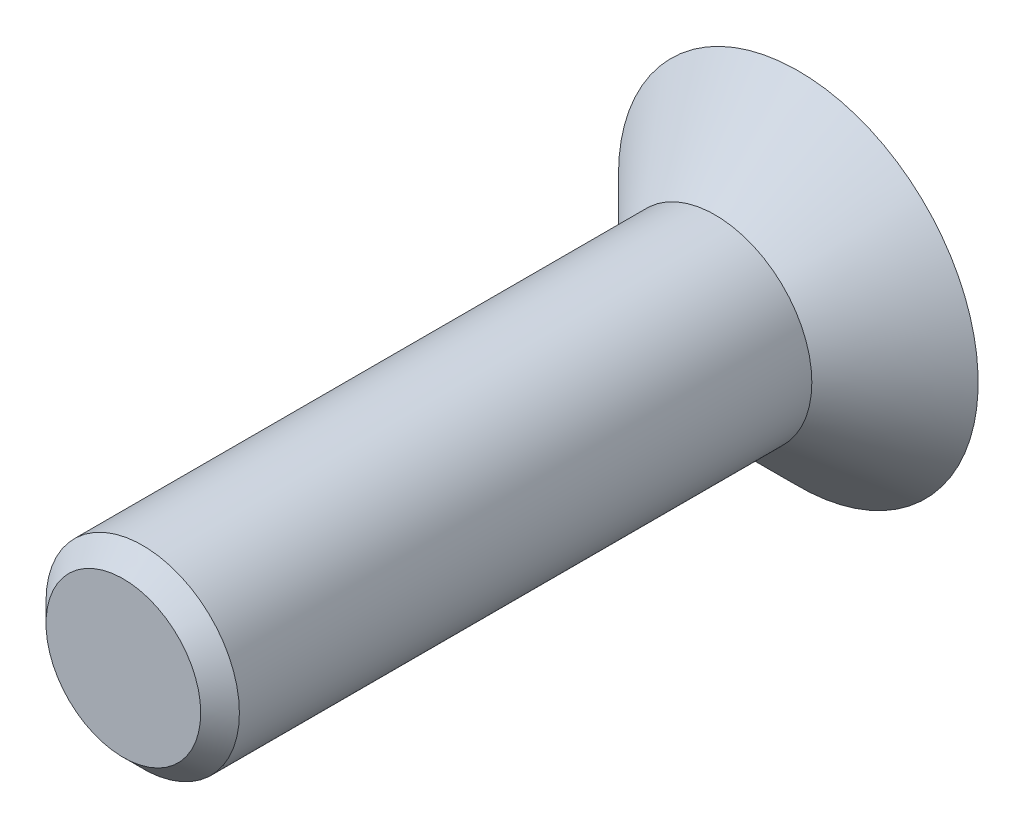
ISO-10303-21;
HEADER;
FILE_DESCRIPTION(('STEP AP214'),'2;1');
FILE_NAME('part.step','',(''),(''),'','','');
FILE_SCHEMA(('AUTOMOTIVE_DESIGN { 1 0 10303 214 1 1 1 1 }'));
ENDSEC;
DATA;
#1=APPLICATION_CONTEXT('core data for automotive mechanical design processes');
#2=APPLICATION_PROTOCOL_DEFINITION('international standard','automotive_design',2000,#1);
#3=PRODUCT_CONTEXT('',#1,'mechanical');
#4=PRODUCT('Part','Part','',(#3));
#5=PRODUCT_RELATED_PRODUCT_CATEGORY('part','',(#4));
#6=PRODUCT_DEFINITION_FORMATION('','',#4);
#7=PRODUCT_DEFINITION_CONTEXT('part definition',#1,'design');
#8=PRODUCT_DEFINITION('design','',#6,#7);
#9=PRODUCT_DEFINITION_SHAPE('','',#8);
#10=(LENGTH_UNIT() NAMED_UNIT(*) SI_UNIT(.MILLI.,.METRE.));
#11=(NAMED_UNIT(*) PLANE_ANGLE_UNIT() SI_UNIT($,.RADIAN.));
#12=(NAMED_UNIT(*) SI_UNIT($,.STERADIAN.) SOLID_ANGLE_UNIT());
#13=UNCERTAINTY_MEASURE_WITH_UNIT(LENGTH_MEASURE(1.E-05),#10,'distance_accuracy_value','');
#14=(GEOMETRIC_REPRESENTATION_CONTEXT(3) GLOBAL_UNCERTAINTY_ASSIGNED_CONTEXT((#13)) GLOBAL_UNIT_ASSIGNED_CONTEXT((#10,
#11,#12)) REPRESENTATION_CONTEXT('',''));
#15=CARTESIAN_POINT('',(0.,0.,0.));
#16=DIRECTION('',(0.,0.,1.));
#17=DIRECTION('',(1.,0.,0.));
#18=AXIS2_PLACEMENT_3D('',#15,#16,#17);
#19=CARTESIAN_POINT('',(1.31838984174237E-13,0.,-2.14999999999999));
#20=DIRECTION('',(0.,0.,1.));
#21=DIRECTION('',(1.,0.,0.));
#22=AXIS2_PLACEMENT_3D('',#19,#20,#21);
#23=PLANE('',#22);
#24=CARTESIAN_POINT('',(1.31838984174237E-13,0.,-2.14999999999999));
#25=DIRECTION('',(0.,0.,-1.));
#26=DIRECTION('',(-1.,0.,0.));
#27=AXIS2_PLACEMENT_3D('',#24,#25,#26);
#28=CIRCLE('',#27,4.65);
#29=CARTESIAN_POINT('',(-4.64999999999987,0.,-2.15));
#30=VERTEX_POINT('',#29);
#31=EDGE_CURVE('E98',#30,#30,#28,.T.);
#32=ORIENTED_EDGE('',*,*,#31,.T.);
#33=EDGE_LOOP('',(#32));
#34=FACE_BOUND('',#33,.T.);
#35=DIRECTION('',(-0.86602540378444,0.499999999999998,0.));
#36=VECTOR('',#35,1.);
#37=CARTESIAN_POINT('',(0.,1.73205080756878,-2.14999999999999));
#38=LINE('',#37,#36);
#39=CARTESIAN_POINT('',(1.50000000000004,0.866025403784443,-2.14999999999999));
#40=VERTEX_POINT('',#39);
#41=CARTESIAN_POINT('',(0.,1.73205080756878,-2.14999999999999));
#42=VERTEX_POINT('',#41);
#43=EDGE_CURVE('E45',#40,#42,#38,.T.);
#44=ORIENTED_EDGE('',*,*,#43,.T.);
#45=DIRECTION('',(-0.866025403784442,-0.500000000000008,0.));
#46=VECTOR('',#45,1.);
#47=CARTESIAN_POINT('',(-1.49999999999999,0.866025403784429,-2.14999999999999));
#48=LINE('',#47,#46);
#49=CARTESIAN_POINT('',(-1.49999999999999,0.866025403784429,-2.14999999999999));
#50=VERTEX_POINT('',#49);
#51=EDGE_CURVE('E97',#42,#50,#48,.T.);
#52=ORIENTED_EDGE('',*,*,#51,.T.);
#53=DIRECTION('',(0.,-1.00000000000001,0.));
#54=VECTOR('',#53,1.);
#55=CARTESIAN_POINT('',(-1.49999999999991,-0.866025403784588,-2.14999999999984));
#56=LINE('',#55,#54);
#57=CARTESIAN_POINT('',(-1.49999999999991,-0.866025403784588,-2.14999999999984));
#58=VERTEX_POINT('',#57);
#59=EDGE_CURVE('E148',#50,#58,#56,.T.);
#60=ORIENTED_EDGE('',*,*,#59,.T.);
#61=DIRECTION('',(0.866025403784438,-0.500000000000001,0.));
#62=VECTOR('',#61,1.);
#63=CARTESIAN_POINT('',(-1.49999999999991,-0.866025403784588,-2.14999999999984));
#64=LINE('',#63,#62);
#65=CARTESIAN_POINT('',(0.,-1.73205080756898,-2.14999999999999));
#66=VERTEX_POINT('',#65);
#67=EDGE_CURVE('E154',#58,#66,#64,.T.);
#68=ORIENTED_EDGE('',*,*,#67,.T.);
#69=DIRECTION('',(0.866025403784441,0.500000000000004,0.));
#70=VECTOR('',#69,1.);
#71=CARTESIAN_POINT('',(0.,-1.73205080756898,-2.14999999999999));
#72=LINE('',#71,#70);
#73=CARTESIAN_POINT('',(1.50000000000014,-0.866025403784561,-2.15000000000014));
#74=VERTEX_POINT('',#73);
#75=EDGE_CURVE('E157',#66,#74,#72,.T.);
#76=ORIENTED_EDGE('',*,*,#75,.T.);
#77=DIRECTION('',(0.,1.00000000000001,0.));
#78=VECTOR('',#77,1.);
#79=CARTESIAN_POINT('',(1.50000000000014,-0.866025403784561,-2.15000000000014));
#80=LINE('',#79,#78);
#81=EDGE_CURVE('E145',#74,#40,#80,.T.);
#82=ORIENTED_EDGE('',*,*,#81,.T.);
#83=EDGE_LOOP('',(#44,#52,#60,#68,#76,#82));
#84=FACE_BOUND('',#83,.T.);
#85=ADVANCED_FACE('F31',(#34,#84),#23,.F.);
#86=CARTESIAN_POINT('',(0.,0.,0.));
#87=DIRECTION('',(0.,0.,-1.));
#88=DIRECTION('',(-1.,0.,0.));
#89=AXIS2_PLACEMENT_3D('',#86,#87,#88);
#90=CONICAL_SURFACE('',#89,2.5,0.78539816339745);
#91=ORIENTED_EDGE('',*,*,#31,.F.);
#92=EDGE_LOOP('',(#91));
#93=FACE_BOUND('',#92,.T.);
#94=CARTESIAN_POINT('',(0.,0.,0.));
#95=DIRECTION('',(0.,0.,1.));
#96=DIRECTION('',(1.,0.,0.));
#97=AXIS2_PLACEMENT_3D('',#94,#95,#96);
#98=CIRCLE('',#97,2.5);
#99=CARTESIAN_POINT('',(2.5,0.,0.));
#100=VERTEX_POINT('',#99);
#101=EDGE_CURVE('E146',#100,#100,#98,.T.);
#102=ORIENTED_EDGE('',*,*,#101,.F.);
#103=EDGE_LOOP('',(#102));
#104=FACE_BOUND('',#103,.T.);
#105=ADVANCED_FACE('F133',(#93,#104),#90,.T.);
#106=CARTESIAN_POINT('',(0.,1.73205080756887,0.250000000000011));
#107=DIRECTION('',(-0.500000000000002,-0.866025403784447,0.));
#108=DIRECTION('',(0.86602540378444,-0.499999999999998,0.));
#109=AXIS2_PLACEMENT_3D('',#106,#107,#108);
#110=PLANE('',#109);
#111=DIRECTION('',(-0.86602540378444,0.499999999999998,0.));
#112=VECTOR('',#111,1.);
#113=CARTESIAN_POINT('',(0.750000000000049,1.29903810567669,0.));
#114=LINE('',#113,#112);
#115=CARTESIAN_POINT('',(1.50000000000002,0.86602540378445,0.));
#116=VERTEX_POINT('',#115);
#117=CARTESIAN_POINT('',(0.,1.73205080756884,0.));
#118=VERTEX_POINT('',#117);
#119=EDGE_CURVE('E84',#116,#118,#114,.T.);
#120=ORIENTED_EDGE('',*,*,#119,.T.);
#121=DIRECTION('',(0.,0.,-1.));
#122=VECTOR('',#121,1.);
#123=CARTESIAN_POINT('',(0.,1.73205080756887,0.250000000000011));
#124=LINE('',#123,#122);
#125=EDGE_CURVE('E91',#118,#42,#124,.T.);
#126=ORIENTED_EDGE('',*,*,#125,.T.);
#127=ORIENTED_EDGE('',*,*,#43,.F.);
#128=DIRECTION('',(0.,0.,-1.));
#129=VECTOR('',#128,1.);
#130=CARTESIAN_POINT('',(1.50000000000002,0.86602540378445,0.250000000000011));
#131=LINE('',#130,#129);
#132=EDGE_CURVE('E93',#116,#40,#131,.T.);
#133=ORIENTED_EDGE('',*,*,#132,.F.);
#134=EDGE_LOOP('',(#120,#126,#127,#133));
#135=FACE_BOUND('',#134,.T.);
#136=ADVANCED_FACE('F90',(#135),#110,.T.);
#137=CARTESIAN_POINT('',(-1.49999999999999,0.866025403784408,0.250000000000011));
#138=DIRECTION('',(0.500000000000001,-0.866025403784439,0.));
#139=DIRECTION('',(0.866025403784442,0.500000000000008,0.));
#140=AXIS2_PLACEMENT_3D('',#137,#138,#139);
#141=PLANE('',#140);
#142=DIRECTION('',(-0.866025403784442,-0.500000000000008,0.));
#143=VECTOR('',#142,1.);
#144=CARTESIAN_POINT('',(-0.749999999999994,1.29903810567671,0.));
#145=LINE('',#144,#143);
#146=CARTESIAN_POINT('',(-1.49999999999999,0.866025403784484,0.));
#147=VERTEX_POINT('',#146);
#148=EDGE_CURVE('E81',#118,#147,#145,.T.);
#149=ORIENTED_EDGE('',*,*,#148,.T.);
#150=DIRECTION('',(0.,0.,-1.));
#151=VECTOR('',#150,1.);
#152=CARTESIAN_POINT('',(-1.49999999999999,0.866025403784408,0.250000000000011));
#153=LINE('',#152,#151);
#154=EDGE_CURVE('E99',#147,#50,#153,.T.);
#155=ORIENTED_EDGE('',*,*,#154,.T.);
#156=ORIENTED_EDGE('',*,*,#51,.F.);
#157=ORIENTED_EDGE('',*,*,#125,.F.);
#158=EDGE_LOOP('',(#149,#155,#156,#157));
#159=FACE_BOUND('',#158,.T.);
#160=ADVANCED_FACE('F95',(#159),#141,.T.);
#161=CARTESIAN_POINT('',(-1.49999999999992,-0.866025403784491,0.25000000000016));
#162=DIRECTION('',(1.,0.,0.));
#163=DIRECTION('',(0.,0.,-1.));
#164=AXIS2_PLACEMENT_3D('',#161,#162,#163);
#165=PLANE('',#164);
#166=DIRECTION('',(0.,-1.00000000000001,0.));
#167=VECTOR('',#166,1.);
#168=CARTESIAN_POINT('',(-1.49999999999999,0.,0.));
#169=LINE('',#168,#167);
#170=CARTESIAN_POINT('',(-1.49999999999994,-0.866025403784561,1.52655665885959E-13));
#171=VERTEX_POINT('',#170);
#172=EDGE_CURVE('E53',#147,#171,#169,.T.);
#173=ORIENTED_EDGE('',*,*,#172,.T.);
#174=DIRECTION('',(0.,0.,-1.));
#175=VECTOR('',#174,1.);
#176=CARTESIAN_POINT('',(-1.49999999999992,-0.866025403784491,0.25000000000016));
#177=LINE('',#176,#175);
#178=EDGE_CURVE('E104',#171,#58,#177,.T.);
#179=ORIENTED_EDGE('',*,*,#178,.T.);
#180=ORIENTED_EDGE('',*,*,#59,.F.);
#181=ORIENTED_EDGE('',*,*,#154,.F.);
#182=EDGE_LOOP('',(#173,#179,#180,#181));
#183=FACE_BOUND('',#182,.T.);
#184=ADVANCED_FACE('F168',(#183),#165,.T.);
#185=CARTESIAN_POINT('',(-1.49999999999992,-0.866025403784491,0.25000000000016));
#186=DIRECTION('',(0.500000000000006,0.866025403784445,0.));
#187=DIRECTION('',(-0.866025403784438,0.500000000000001,0.));
#188=AXIS2_PLACEMENT_3D('',#185,#186,#187);
#189=PLANE('',#188);
#190=DIRECTION('',(0.866025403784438,-0.500000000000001,0.));
#191=VECTOR('',#190,1.);
#192=CARTESIAN_POINT('',(-0.749999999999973,-1.29903810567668,0.));
#193=LINE('',#192,#191);
#194=CARTESIAN_POINT('',(0.,-1.73205080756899,0.));
#195=VERTEX_POINT('',#194);
#196=EDGE_CURVE('E112',#171,#195,#193,.T.);
#197=ORIENTED_EDGE('',*,*,#196,.T.);
#198=DIRECTION('',(0.,0.,-1.));
#199=VECTOR('',#198,1.);
#200=CARTESIAN_POINT('',(0.,-1.732050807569,0.250000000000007));
#201=LINE('',#200,#199);
#202=EDGE_CURVE('E163',#195,#66,#201,.T.);
#203=ORIENTED_EDGE('',*,*,#202,.T.);
#204=ORIENTED_EDGE('',*,*,#67,.F.);
#205=ORIENTED_EDGE('',*,*,#178,.F.);
#206=EDGE_LOOP('',(#197,#203,#204,#205));
#207=FACE_BOUND('',#206,.T.);
#208=ADVANCED_FACE('F170',(#207),#189,.T.);
#209=CARTESIAN_POINT('',(0.,-1.732050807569,0.250000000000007));
#210=DIRECTION('',(-0.499999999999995,0.866025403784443,0.));
#211=DIRECTION('',(-0.866025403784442,-0.500000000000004,0.));
#212=AXIS2_PLACEMENT_3D('',#209,#210,#211);
#213=PLANE('',#212);
#214=DIRECTION('',(0.866025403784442,0.500000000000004,0.));
#215=VECTOR('',#214,1.);
#216=CARTESIAN_POINT('',(0.750000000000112,-1.29903810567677,1.56125112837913E-13));
#217=LINE('',#216,#215);
#218=CARTESIAN_POINT('',(1.50000000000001,-0.866025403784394,-1.49186218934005E-13));
#219=VERTEX_POINT('',#218);
#220=EDGE_CURVE('E109',#195,#219,#217,.T.);
#221=ORIENTED_EDGE('',*,*,#220,.T.);
#222=DIRECTION('',(0.,0.,-1.));
#223=VECTOR('',#222,1.);
#224=CARTESIAN_POINT('',(1.50000000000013,-0.866025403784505,0.249999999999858));
#225=LINE('',#224,#223);
#226=EDGE_CURVE('E161',#219,#74,#225,.T.);
#227=ORIENTED_EDGE('',*,*,#226,.T.);
#228=ORIENTED_EDGE('',*,*,#75,.F.);
#229=ORIENTED_EDGE('',*,*,#202,.F.);
#230=EDGE_LOOP('',(#221,#227,#228,#229));
#231=FACE_BOUND('',#230,.T.);
#232=ADVANCED_FACE('F174',(#231),#213,.T.);
#233=CARTESIAN_POINT('',(1.50000000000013,-0.866025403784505,0.249999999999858));
#234=DIRECTION('',(-1.,0.,0.));
#235=DIRECTION('',(0.,0.,1.));
#236=AXIS2_PLACEMENT_3D('',#233,#234,#235);
#237=PLANE('',#236);
#238=DIRECTION('',(0.,1.00000000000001,0.));
#239=VECTOR('',#238,1.);
#240=CARTESIAN_POINT('',(1.50000000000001,0.,0.));
#241=LINE('',#240,#239);
#242=EDGE_CURVE('E102',#219,#116,#241,.T.);
#243=ORIENTED_EDGE('',*,*,#242,.T.);
#244=ORIENTED_EDGE('',*,*,#132,.T.);
#245=ORIENTED_EDGE('',*,*,#81,.F.);
#246=ORIENTED_EDGE('',*,*,#226,.F.);
#247=EDGE_LOOP('',(#243,#244,#245,#246));
#248=FACE_BOUND('',#247,.T.);
#249=ADVANCED_FACE('F177',(#248),#237,.T.);
#250=CARTESIAN_POINT('',(0.,0.,0.));
#251=DIRECTION('',(0.,0.,-1.));
#252=DIRECTION('',(-1.,0.,0.));
#253=AXIS2_PLACEMENT_3D('',#250,#251,#252);
#254=PLANE('',#253);
#255=ORIENTED_EDGE('',*,*,#119,.F.);
#256=ORIENTED_EDGE('',*,*,#242,.F.);
#257=ORIENTED_EDGE('',*,*,#220,.F.);
#258=ORIENTED_EDGE('',*,*,#196,.F.);
#259=ORIENTED_EDGE('',*,*,#172,.F.);
#260=ORIENTED_EDGE('',*,*,#148,.F.);
#261=EDGE_LOOP('',(#255,#256,#257,#258,#259,#260));
#262=FACE_BOUND('',#261,.T.);
#263=ADVANCED_FACE('F83',(#262),#254,.T.);
#264=CARTESIAN_POINT('',(1.45716771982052E-13,0.,15.3));
#265=DIRECTION('',(0.,0.,1.));
#266=DIRECTION('',(1.,0.,0.));
#267=AXIS2_PLACEMENT_3D('',#264,#265,#266);
#268=PLANE('',#267);
#269=CARTESIAN_POINT('',(1.45716771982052E-13,0.,15.3));
#270=DIRECTION('',(0.,0.,1.));
#271=DIRECTION('',(1.,0.,0.));
#272=AXIS2_PLACEMENT_3D('',#269,#270,#271);
#273=CIRCLE('',#272,1.99999999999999);
#274=CARTESIAN_POINT('',(2.00000000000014,0.,15.3));
#275=VERTEX_POINT('',#274);
#276=EDGE_CURVE('E38',#275,#275,#273,.T.);
#277=ORIENTED_EDGE('',*,*,#276,.T.);
#278=EDGE_LOOP('',(#277));
#279=FACE_BOUND('',#278,.T.);
#280=ADVANCED_FACE('F118',(#279),#268,.T.);
#281=CARTESIAN_POINT('',(0.,0.,0.));
#282=DIRECTION('',(0.,0.,1.));
#283=DIRECTION('',(1.,0.,0.));
#284=AXIS2_PLACEMENT_3D('',#281,#282,#283);
#285=CYLINDRICAL_SURFACE('',#284,2.5);
#286=CARTESIAN_POINT('',(1.45716771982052E-13,0.,14.8));
#287=DIRECTION('',(0.,0.,1.));
#288=DIRECTION('',(1.,0.,0.));
#289=AXIS2_PLACEMENT_3D('',#286,#287,#288);
#290=CIRCLE('',#289,2.5);
#291=CARTESIAN_POINT('',(2.50000000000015,0.,14.8));
#292=VERTEX_POINT('',#291);
#293=EDGE_CURVE('E11',#292,#292,#290,.F.);
#294=ORIENTED_EDGE('',*,*,#293,.T.);
#295=EDGE_LOOP('',(#294));
#296=FACE_BOUND('',#295,.T.);
#297=ORIENTED_EDGE('',*,*,#101,.T.);
#298=EDGE_LOOP('',(#297));
#299=FACE_BOUND('',#298,.T.);
#300=ADVANCED_FACE('F122',(#296,#299),#285,.T.);
#301=CARTESIAN_POINT('',(1.45716771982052E-13,0.,15.3));
#302=DIRECTION('',(0.,0.,-1.));
#303=DIRECTION('',(-1.,0.,0.));
#304=AXIS2_PLACEMENT_3D('',#301,#302,#303);
#305=CONICAL_SURFACE('',#304,1.99999999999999,0.785398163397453);
#306=ORIENTED_EDGE('',*,*,#293,.F.);
#307=EDGE_LOOP('',(#306));
#308=FACE_BOUND('',#307,.T.);
#309=ORIENTED_EDGE('',*,*,#276,.F.);
#310=EDGE_LOOP('',(#309));
#311=FACE_BOUND('',#310,.T.);
#312=ADVANCED_FACE('F120',(#308,#311),#305,.T.);
#313=CLOSED_SHELL('',(#85,#105,#136,#160,#184,#208,#232,#249,#263,#280,#300,#312));
#314=MANIFOLD_SOLID_BREP('B2',#313);
#315=ADVANCED_BREP_SHAPE_REPRESENTATION('',(#18,#314),#14);
#316=SHAPE_DEFINITION_REPRESENTATION(#9,#315);
ENDSEC;
END-ISO-10303-21;
